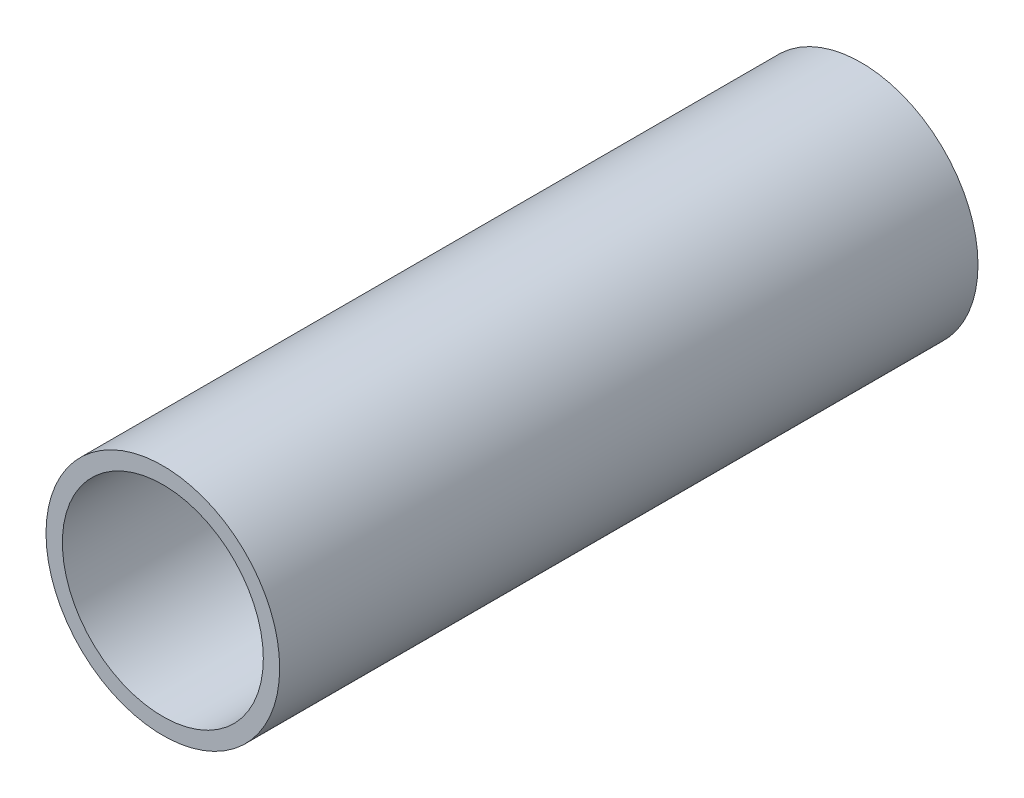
from build123d import *

# Parameters (mm, degrees)
SKETCH1_R           = 8.5
SKETCH1_R_2         = 7.309375
BOSS_EXTRUDE1_DEPTH = 50.8


with BuildPart() as part:
    # Sketch1 → Boss-Extrude1 (new body)
    with BuildSketch(Plane.XY):
        Circle(SKETCH1_R)
        Circle(SKETCH1_R_2, mode=Mode.SUBTRACT)
    extrude(amount=BOSS_EXTRUDE1_DEPTH)


solid = part.part
